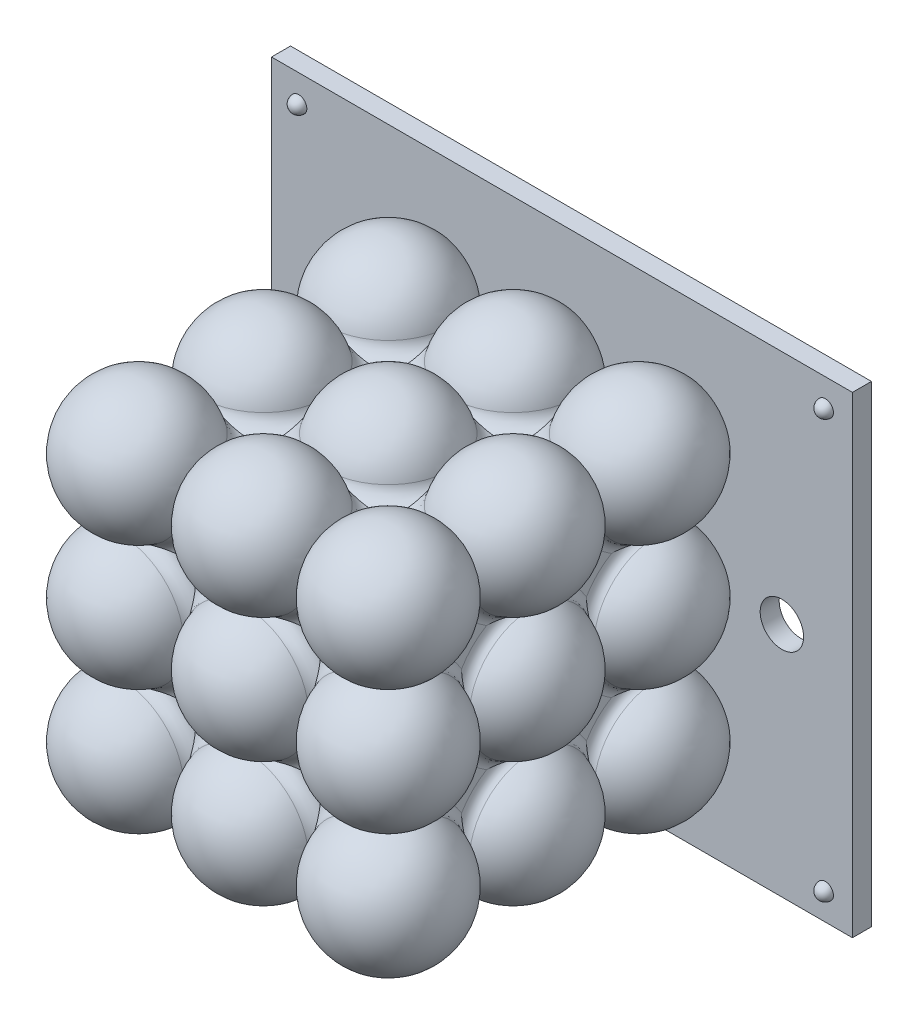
from build123d import *

# Parameters (mm, degrees)
LPATTERN3_COUNT      = 3
LPATTERN3_PITCH      = 23
LPATTERN4_COUNT      = 3
LPATTERN4_PITCH      = 23
LPATTERN5_COUNT      = 3
LPATTERN5_PITCH      = 23
SKETCH2_W            = 48
SKETCH2_H            = 48
BOSS_EXTRUDE1_DEPTH  = 48
SKETCH3_W            = 107
SKETCH3_H            = 87
BOSS_EXTRUDE2_DEPTH  = 3.5
SKETCH4_R            = 4
CUT_EXTRUDE1_DEPTH   = 18
LPATTERN6_COUNT      = 2
LPATTERN6_PITCH      = 77
LPATTERN6_COUNT_DIR2 = 2
LPATTERN6_PITCH_DIR2 = 97
FILLET1_R            = 3
FILLET5_R            = 3
FILLET6_R            = 3
FILLET7_R            = 3
FILLET8_R            = 1.99


with BuildPart() as part:
    # Sketch1 → Revolve1 (revolve)
    with BuildSketch(Plane.XY):
        with BuildLine():
            Line((0, 12), (0, -12))
            ThreePointArc((0, -12), (12, 0), (0, 12))
        make_face()
    revolve1 = revolve(axis=Axis((0, 20.540405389, 0), (0, -1, 0)))

    # LPattern3: Revolve1 ×3
    with Locations(*[(i * LPATTERN3_PITCH, 0, 0) for i in range(1, LPATTERN3_COUNT)]):
        add(revolve1)

    # LPattern4: Revolve1 ×3
    with Locations(*[(0, 0, i * LPATTERN4_PITCH) for i in range(1, LPATTERN4_COUNT)]):
        add(revolve1)

    # LPattern4 copy 1 sketch → LPattern4 copy 1 (revolve)
    with BuildSketch(Plane(origin=(23, 0, 23), x_dir=(1, 0, 0), z_dir=(0, 0, 1))):
        with BuildLine():
            Line((0, 12), (0, -12))
            ThreePointArc((0, -12), (12, 0), (0, 12))
        make_face()
    revolve(axis=Axis((23, 20.540405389, 23), (0, -1, 0)))

    # LPattern4 copy 2 sketch → LPattern4 copy 2 (revolve)
    with BuildSketch(Plane(origin=(23, 0, 46), x_dir=(1, 0, 0), z_dir=(0, 0, 1))):
        with BuildLine():
            Line((0, 12), (0, -12))
            ThreePointArc((0, -12), (12, 0), (0, 12))
        make_face()
    revolve(axis=Axis((23, 20.540405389, 46), (0, -1, 0)))

    # LPattern4 copy 3 sketch → LPattern4 copy 3 (revolve)
    with BuildSketch(Plane(origin=(46, 0, 23), x_dir=(1, 0, 0), z_dir=(0, 0, 1))):
        with BuildLine():
            Line((0, 12), (0, -12))
            ThreePointArc((0, -12), (12, 0), (0, 12))
        make_face()
    revolve(axis=Axis((46, 20.540405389, 23), (0, -1, 0)))

    # LPattern4 copy 4 sketch → LPattern4 copy 4 (revolve)
    with BuildSketch(Plane(origin=(46, 0, 46), x_dir=(1, 0, 0), z_dir=(0, 0, 1))):
        with BuildLine():
            Line((0, 12), (0, -12))
            ThreePointArc((0, -12), (12, 0), (0, 12))
        make_face()
    revolve(axis=Axis((46, 20.540405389, 46), (0, -1, 0)))

    # LPattern5: Revolve1 ×3
    with Locations(*[(0, i * LPATTERN5_PITCH, 0) for i in range(1, LPATTERN5_COUNT)]):
        add(revolve1)

    # LPattern5 copy 1 sketch → LPattern5 copy 1 (revolve)
    with BuildSketch(Plane(origin=(23, 23, 0), x_dir=(1, 0, 0), z_dir=(0, 0, 1))):
        with BuildLine():
            Line((0, 12), (0, -12))
            ThreePointArc((0, -12), (12, 0), (0, 12))
        make_face()
    revolve(axis=Axis((23, 43.540405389, 0), (0, -1, 0)))

    # LPattern5 copy 2 sketch → LPattern5 copy 2 (revolve)
    with BuildSketch(Plane(origin=(23, 46, 0), x_dir=(1, 0, 0), z_dir=(0, 0, 1))):
        with BuildLine():
            Line((0, 12), (0, -12))
            ThreePointArc((0, -12), (12, 0), (0, 12))
        make_face()
    revolve(axis=Axis((23, 66.540405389, 0), (0, -1, 0)))

    # LPattern5 copy 3 sketch → LPattern5 copy 3 (revolve)
    with BuildSketch(Plane(origin=(46, 23, 0), x_dir=(1, 0, 0), z_dir=(0, 0, 1))):
        with BuildLine():
            Line((0, 12), (0, -12))
            ThreePointArc((0, -12), (12, 0), (0, 12))
        make_face()
    revolve(axis=Axis((46, 43.540405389, 0), (0, -1, 0)))

    # LPattern5 copy 4 sketch → LPattern5 copy 4 (revolve)
    with BuildSketch(Plane(origin=(46, 46, 0), x_dir=(1, 0, 0), z_dir=(0, 0, 1))):
        with BuildLine():
            Line((0, 12), (0, -12))
            ThreePointArc((0, -12), (12, 0), (0, 12))
        make_face()
    revolve(axis=Axis((46, 66.540405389, 0), (0, -1, 0)))

    # LPattern5 copy 5 sketch → LPattern5 copy 5 (revolve)
    with BuildSketch(Plane(origin=(0, 23, 23), x_dir=(1, 0, 0), z_dir=(0, 0, 1))):
        with BuildLine():
            Line((0, 12), (0, -12))
            ThreePointArc((0, -12), (12, 0), (0, 12))
        make_face()
    revolve(axis=Axis((0, 43.540405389, 23), (0, -1, 0)))

    # LPattern5 copy 6 sketch → LPattern5 copy 6 (revolve)
    with BuildSketch(Plane(origin=(0, 46, 23), x_dir=(1, 0, 0), z_dir=(0, 0, 1))):
        with BuildLine():
            Line((0, 12), (0, -12))
            ThreePointArc((0, -12), (12, 0), (0, 12))
        make_face()
    revolve(axis=Axis((0, 66.540405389, 23), (0, -1, 0)))

    # LPattern5 copy 7 sketch → LPattern5 copy 7 (revolve)
    with BuildSketch(Plane(origin=(0, 23, 46), x_dir=(1, 0, 0), z_dir=(0, 0, 1))):
        with BuildLine():
            Line((0, 12), (0, -12))
            ThreePointArc((0, -12), (12, 0), (0, 12))
        make_face()
    revolve(axis=Axis((0, 43.540405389, 46), (0, -1, 0)))

    # LPattern5 copy 8 sketch → LPattern5 copy 8 (revolve)
    with BuildSketch(Plane(origin=(0, 46, 46), x_dir=(1, 0, 0), z_dir=(0, 0, 1))):
        with BuildLine():
            Line((0, 12), (0, -12))
            ThreePointArc((0, -12), (12, 0), (0, 12))
        make_face()
    revolve(axis=Axis((0, 66.540405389, 46), (0, -1, 0)))

    # LPattern5 copy 9 sketch → LPattern5 copy 9 (revolve)
    with BuildSketch(Plane(origin=(23, 23, 23), x_dir=(1, 0, 0), z_dir=(0, 0, 1))):
        with BuildLine():
            Line((0, 12), (0, -12))
            ThreePointArc((0, -12), (12, 0), (0, 12))
        make_face()
    revolve(axis=Axis((23, 43.540405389, 23), (0, -1, 0)))

    # LPattern5 copy 10 sketch → LPattern5 copy 10 (revolve)
    with BuildSketch(Plane(origin=(23, 46, 23), x_dir=(1, 0, 0), z_dir=(0, 0, 1))):
        with BuildLine():
            Line((0, 12), (0, -12))
            ThreePointArc((0, -12), (12, 0), (0, 12))
        make_face()
    revolve(axis=Axis((23, 66.540405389, 23), (0, -1, 0)))

    # LPattern5 copy 11 sketch → LPattern5 copy 11 (revolve)
    with BuildSketch(Plane(origin=(23, 23, 46), x_dir=(1, 0, 0), z_dir=(0, 0, 1))):
        with BuildLine():
            Line((0, 12), (0, -12))
            ThreePointArc((0, -12), (12, 0), (0, 12))
        make_face()
    revolve(axis=Axis((23, 43.540405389, 46), (0, -1, 0)))

    # LPattern5 copy 12 sketch → LPattern5 copy 12 (revolve)
    with BuildSketch(Plane(origin=(23, 46, 46), x_dir=(1, 0, 0), z_dir=(0, 0, 1))):
        with BuildLine():
            Line((0, 12), (0, -12))
            ThreePointArc((0, -12), (12, 0), (0, 12))
        make_face()
    revolve(axis=Axis((23, 66.540405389, 46), (0, -1, 0)))

    # LPattern5 copy 13 sketch → LPattern5 copy 13 (revolve)
    with BuildSketch(Plane(origin=(46, 23, 23), x_dir=(1, 0, 0), z_dir=(0, 0, 1))):
        with BuildLine():
            Line((0, 12), (0, -12))
            ThreePointArc((0, -12), (12, 0), (0, 12))
        make_face()
    revolve(axis=Axis((46, 43.540405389, 23), (0, -1, 0)))

    # LPattern5 copy 14 sketch → LPattern5 copy 14 (revolve)
    with BuildSketch(Plane(origin=(46, 46, 23), x_dir=(1, 0, 0), z_dir=(0, 0, 1))):
        with BuildLine():
            Line((0, 12), (0, -12))
            ThreePointArc((0, -12), (12, 0), (0, 12))
        make_face()
    revolve(axis=Axis((46, 66.540405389, 23), (0, -1, 0)))

    # LPattern5 copy 15 sketch → LPattern5 copy 15 (revolve)
    with BuildSketch(Plane(origin=(46, 23, 46), x_dir=(1, 0, 0), z_dir=(0, 0, 1))):
        with BuildLine():
            Line((0, 12), (0, -12))
            ThreePointArc((0, -12), (12, 0), (0, 12))
        make_face()
    revolve(axis=Axis((46, 43.540405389, 46), (0, -1, 0)))

    # LPattern5 copy 16 sketch → LPattern5 copy 16 (revolve)
    with BuildSketch(Plane(origin=(46, 46, 46), x_dir=(1, 0, 0), z_dir=(0, 0, 1))):
        with BuildLine():
            Line((0, 12), (0, -12))
            ThreePointArc((0, -12), (12, 0), (0, 12))
        make_face()
    revolve(axis=Axis((46, 66.540405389, 46), (0, -1, 0)))

    # Sketch2 → Boss-Extrude1 (add)
    with BuildSketch(Plane(origin=(0, 0, 0), x_dir=(0, 0, -1), z_dir=(1, 0, 0))):
        with Locations((-23, 23)):
            Rectangle(SKETCH2_W, SKETCH2_H)
    extrude(amount=BOSS_EXTRUDE1_DEPTH)

    # Sketch3 → Boss-Extrude2 (add)
    with BuildSketch(Plane.XY.offset(-9)):
        with Locations((23, 23)):
            Rectangle(SKETCH3_W, SKETCH3_H)
    extrude(amount=-BOSS_EXTRUDE2_DEPTH)

    # Sketch4 → Cut-Extrude1 (cut)
    with BuildSketch(Plane(origin=(0, 0, -12.5), x_dir=(-1, 0, 0), z_dir=(0, 0, -1))):
        with Locations((-63.5, 23)):
            Circle(SKETCH4_R)
        with Locations((17.5, 23)):
            Circle(SKETCH4_R)
    extrude(amount=-CUT_EXTRUDE1_DEPTH, mode=Mode.SUBTRACT)

    # Sketch5 → Revolve3 (revolve)
    with BuildSketch(Plane(origin=(0, 61.5, 0), x_dir=(1, 0, 0), z_dir=(0, 1, 0))):
        with BuildLine():
            Line((71.5, 10.5), (71.5, 7.5))
            ThreePointArc((71.5, 7.5), (73, 9), (71.5, 10.5))
        make_face()
    revolve3 = revolve(axis=Axis((71.5, 61.5, -10.5), (0, 0, 1)))

    # LPattern6: Revolve3 2 × 2
    with Locations(*[(-j * LPATTERN6_PITCH_DIR2, -i * LPATTERN6_PITCH, 0) for i in range(LPATTERN6_COUNT) for j in range(LPATTERN6_COUNT_DIR2) if (i, j) != (0, 0)]):
        add(revolve3)

    # Fillet1
    fillet1_edges = [part.edges().sort_by_distance(p)[0] for p in [
        (37.544232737, 37.544232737, 47),
        (14.544232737, 31.455767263, 47),
        (14.544232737, 37.544232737, 47),
        (8.455767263, 37.544232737, 47),
        (8.455767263, 31.455767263, 47),
        (37.544232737, 8.455767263, 47),
        (37.544232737, 14.544232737, 47),
        (31.455767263, 14.544232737, 47),
        (31.455767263, 8.455767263, 47),
        (14.544232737, 8.455767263, 47),
        (14.544232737, 14.544232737, 47),
        (8.455767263, 14.544232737, 47),
        (8.455767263, 8.455767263, 47),
        (31.455767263, 37.544232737, 47),
        (31.455767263, 31.455767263, 47),
        (37.544232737, 31.455767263, 47),
    ]]
    fillet(fillet1_edges, radius=FILLET1_R)

    # Fillet5
    fillet5_edges = [part.edges().sort_by_distance(p)[0] for p in [
        (8.455767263, -1, 8.455767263),
        (37.544232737, -1, 31.455767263),
        (37.544232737, -1, 37.544232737),
        (31.455767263, -1, 37.544232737),
        (31.455767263, -1, 31.455767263),
        (14.544232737, -1, 31.455767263),
        (14.544232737, -1, 37.544232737),
        (8.455767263, -1, 37.544232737),
        (8.455767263, -1, 31.455767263),
        (37.544232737, -1, 8.455767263),
        (37.544232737, -1, 14.544232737),
        (31.455767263, -1, 14.544232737),
        (31.455767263, -1, 8.455767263),
        (14.544232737, -1, 8.455767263),
        (14.544232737, -1, 14.544232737),
        (8.455767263, -1, 14.544232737),
    ]]
    fillet(fillet5_edges, radius=FILLET5_R)

    # Fillet6
    fillet6_edges = [part.edges().sort_by_distance(p)[0] for p in [
        (0, 8.485281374, 8.485281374),
        (0, 14.514718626, 8.485281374),
        (0, 14.514718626, 14.514718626),
        (0, 8.485281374, 14.514718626),
        (0, 14.514718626, 31.485281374),
        (0, 14.514718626, 37.514718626),
        (0, 8.485281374, 37.514718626),
        (0, 8.485281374, 31.485281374),
        (0, 37.514718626, 8.485281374),
        (0, 37.514718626, 14.514718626),
        (0, 31.485281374, 14.514718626),
        (0, 31.485281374, 8.485281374),
        (0, 37.514718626, 31.485281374),
        (0, 37.514718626, 37.514718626),
        (0, 31.485281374, 37.514718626),
        (0, 31.485281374, 31.485281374),
    ]]
    fillet(fillet6_edges, radius=FILLET6_R)

    # Fillet7
    fillet7_edges = [part.edges().sort_by_distance(p)[0] for p in [
        (37.544232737, 47, 37.544232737),
        (8.455767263, 47, 37.544232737),
        (14.544232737, 47, 37.544232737),
        (14.544232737, 47, 31.455767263),
        (8.455767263, 47, 31.455767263),
        (31.455767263, 47, 14.544232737),
        (37.544232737, 47, 14.544232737),
        (37.544232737, 47, 8.455767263),
        (31.455767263, 47, 8.455767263),
        (8.455767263, 47, 14.544232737),
        (14.544232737, 47, 14.544232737),
        (14.544232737, 47, 8.455767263),
        (8.455767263, 47, 8.455767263),
        (37.544232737, 47, 31.455767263),
        (31.455767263, 47, 31.455767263),
        (31.455767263, 47, 37.544232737),
    ]]
    fillet(fillet7_edges, radius=FILLET7_R)

    # Fillet8
    fillet8_edges = [part.edges().sort_by_distance(p)[0] for p in [
        (48, 37.633399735, 37.633399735),
        (48, 37.633399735, 8.366600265),
        (48, 37.633399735, 14.633399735),
        (48, 31.366600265, 14.633399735),
        (48, 31.366600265, 8.366600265),
        (48, 14.633399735, 31.366600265),
        (48, 14.633399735, 37.633399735),
        (48, 8.366600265, 37.633399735),
        (48, 8.366600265, 31.366600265),
        (48, 14.633399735, 8.366600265),
        (48, 14.633399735, 14.633399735),
        (48, 8.366600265, 14.633399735),
        (48, 8.366600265, 8.366600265),
        (48, 31.366600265, 37.633399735),
        (48, 31.366600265, 31.366600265),
        (48, 37.633399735, 31.366600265),
    ]]
    fillet(fillet8_edges, radius=FILLET8_R)


solid = part.part
